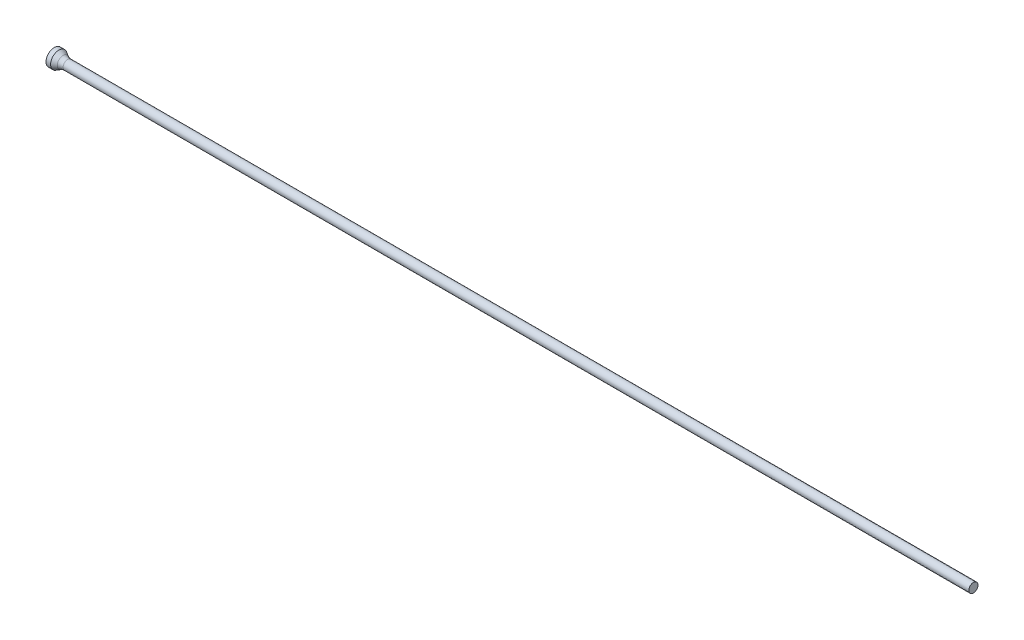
ISO-10303-21;
HEADER;
FILE_DESCRIPTION(('STEP AP214'),'2;1');
FILE_NAME('part.step','',(''),(''),'','','');
FILE_SCHEMA(('AUTOMOTIVE_DESIGN { 1 0 10303 214 1 1 1 1 }'));
ENDSEC;
DATA;
#1=APPLICATION_CONTEXT('core data for automotive mechanical design processes');
#2=APPLICATION_PROTOCOL_DEFINITION('international standard','automotive_design',2000,#1);
#3=PRODUCT_CONTEXT('',#1,'mechanical');
#4=PRODUCT('Part','Part','',(#3));
#5=PRODUCT_RELATED_PRODUCT_CATEGORY('part','',(#4));
#6=PRODUCT_DEFINITION_FORMATION('','',#4);
#7=PRODUCT_DEFINITION_CONTEXT('part definition',#1,'design');
#8=PRODUCT_DEFINITION('design','',#6,#7);
#9=PRODUCT_DEFINITION_SHAPE('','',#8);
#10=(LENGTH_UNIT() NAMED_UNIT(*) SI_UNIT(.MILLI.,.METRE.));
#11=(NAMED_UNIT(*) PLANE_ANGLE_UNIT() SI_UNIT($,.RADIAN.));
#12=(NAMED_UNIT(*) SI_UNIT($,.STERADIAN.) SOLID_ANGLE_UNIT());
#13=UNCERTAINTY_MEASURE_WITH_UNIT(LENGTH_MEASURE(1.E-05),#10,'distance_accuracy_value','');
#14=(GEOMETRIC_REPRESENTATION_CONTEXT(3) GLOBAL_UNCERTAINTY_ASSIGNED_CONTEXT((#13)) GLOBAL_UNIT_ASSIGNED_CONTEXT((#10,
#11,#12)) REPRESENTATION_CONTEXT('',''));
#15=CARTESIAN_POINT('',(0.,0.,0.));
#16=DIRECTION('',(0.,0.,1.));
#17=DIRECTION('',(1.,0.,0.));
#18=AXIS2_PLACEMENT_3D('',#15,#16,#17);
#19=CARTESIAN_POINT('',(0.,0.,0.));
#20=DIRECTION('',(1.,0.,0.));
#21=DIRECTION('',(0.,0.,-1.));
#22=AXIS2_PLACEMENT_3D('',#19,#20,#21);
#23=PLANE('',#22);
#24=CARTESIAN_POINT('',(0.,0.,0.));
#25=DIRECTION('',(-1.,0.,0.));
#26=DIRECTION('',(0.,0.,1.));
#27=AXIS2_PLACEMENT_3D('',#24,#25,#26);
#28=CIRCLE('',#27,0.9);
#29=CARTESIAN_POINT('',(0.,0.,0.9));
#30=VERTEX_POINT('',#29);
#31=EDGE_CURVE('E25',#30,#30,#28,.T.);
#32=ORIENTED_EDGE('',*,*,#31,.T.);
#33=EDGE_LOOP('',(#32));
#34=FACE_BOUND('',#33,.T.);
#35=ADVANCED_FACE('F14',(#34),#23,.F.);
#36=CARTESIAN_POINT('',(0.,0.,0.));
#37=DIRECTION('',(-1.,0.,0.));
#38=DIRECTION('',(0.,0.,1.));
#39=AXIS2_PLACEMENT_3D('',#36,#37,#38);
#40=CYLINDRICAL_SURFACE('',#39,0.9);
#41=ORIENTED_EDGE('',*,*,#31,.F.);
#42=EDGE_LOOP('',(#41));
#43=FACE_BOUND('',#42,.T.);
#44=CARTESIAN_POINT('',(0.497179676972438,0.,0.));
#45=DIRECTION('',(-1.,0.,0.));
#46=DIRECTION('',(0.,0.,1.));
#47=AXIS2_PLACEMENT_3D('',#44,#45,#46);
#48=CIRCLE('',#47,0.9);
#49=CARTESIAN_POINT('',(0.497179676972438,0.,0.9));
#50=VERTEX_POINT('',#49);
#51=EDGE_CURVE('E29',#50,#50,#48,.T.);
#52=ORIENTED_EDGE('',*,*,#51,.T.);
#53=EDGE_LOOP('',(#52));
#54=FACE_BOUND('',#53,.T.);
#55=ADVANCED_FACE('F53',(#43,#54),#40,.T.);
#56=CARTESIAN_POINT('',(1.19,0.,0.));
#57=DIRECTION('',(-1.,0.,0.));
#58=DIRECTION('',(0.,0.,1.));
#59=AXIS2_PLACEMENT_3D('',#56,#57,#58);
#60=CONICAL_SURFACE('',#59,0.5,0.523598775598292);
#61=CARTESIAN_POINT('',(0.957949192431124,0.,0.));
#62=DIRECTION('',(-1.,0.,0.));
#63=DIRECTION('',(0.,0.,1.));
#64=AXIS2_PLACEMENT_3D('',#61,#62,#63);
#65=CIRCLE('',#64,0.633974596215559);
#66=CARTESIAN_POINT('',(0.957949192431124,0.,0.633974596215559));
#67=VERTEX_POINT('',#66);
#68=EDGE_CURVE('E21',#67,#67,#65,.T.);
#69=ORIENTED_EDGE('',*,*,#68,.T.);
#70=EDGE_LOOP('',(#69));
#71=FACE_BOUND('',#70,.T.);
#72=ORIENTED_EDGE('',*,*,#51,.F.);
#73=EDGE_LOOP('',(#72));
#74=FACE_BOUND('',#73,.T.);
#75=ADVANCED_FACE('F50',(#71,#74),#60,.T.);
#76=CARTESIAN_POINT('',(0.,0.,0.));
#77=DIRECTION('',(-1.,0.,0.));
#78=DIRECTION('',(0.,0.,1.));
#79=AXIS2_PLACEMENT_3D('',#76,#77,#78);
#80=CYLINDRICAL_SURFACE('',#79,0.5);
#81=CARTESIAN_POINT('',(1.45794919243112,0.,0.));
#82=DIRECTION('',(-1.,0.,0.));
#83=DIRECTION('',(0.,0.,1.));
#84=AXIS2_PLACEMENT_3D('',#81,#82,#83);
#85=CIRCLE('',#84,0.5);
#86=CARTESIAN_POINT('',(1.45794919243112,0.,0.5));
#87=VERTEX_POINT('',#86);
#88=EDGE_CURVE('E9',#87,#87,#85,.F.);
#89=ORIENTED_EDGE('',*,*,#88,.T.);
#90=EDGE_LOOP('',(#89));
#91=FACE_BOUND('',#90,.T.);
#92=CARTESIAN_POINT('',(100.,0.,0.));
#93=DIRECTION('',(-1.,0.,0.));
#94=DIRECTION('',(0.,0.,1.));
#95=AXIS2_PLACEMENT_3D('',#92,#93,#94);
#96=CIRCLE('',#95,0.5);
#97=CARTESIAN_POINT('',(100.,0.,0.5));
#98=VERTEX_POINT('',#97);
#99=EDGE_CURVE('E34',#98,#98,#96,.T.);
#100=ORIENTED_EDGE('',*,*,#99,.T.);
#101=EDGE_LOOP('',(#100));
#102=FACE_BOUND('',#101,.T.);
#103=ADVANCED_FACE('F38',(#91,#102),#80,.T.);
#104=CARTESIAN_POINT('',(100.,0.5,0.));
#105=DIRECTION('',(-1.,0.,0.));
#106=DIRECTION('',(0.,0.,1.));
#107=AXIS2_PLACEMENT_3D('',#104,#105,#106);
#108=PLANE('',#107);
#109=ORIENTED_EDGE('',*,*,#99,.F.);
#110=EDGE_LOOP('',(#109));
#111=FACE_BOUND('',#110,.T.);
#112=ADVANCED_FACE('F40',(#111),#108,.F.);
#113=CARTESIAN_POINT('',(1.45794919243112,0.,0.));
#114=DIRECTION('',(-1.,0.,0.));
#115=DIRECTION('',(0.,0.,1.));
#116=AXIS2_PLACEMENT_3D('',#113,#114,#115);
#117=TOROIDAL_SURFACE('',#116,1.5,1.);
#118=ORIENTED_EDGE('',*,*,#88,.F.);
#119=EDGE_LOOP('',(#118));
#120=FACE_BOUND('',#119,.T.);
#121=ORIENTED_EDGE('',*,*,#68,.F.);
#122=EDGE_LOOP('',(#121));
#123=FACE_BOUND('',#122,.T.);
#124=ADVANCED_FACE('F16',(#120,#123),#117,.F.);
#125=CLOSED_SHELL('',(#35,#55,#75,#103,#112,#124));
#126=MANIFOLD_SOLID_BREP('B1',#125);
#127=ADVANCED_BREP_SHAPE_REPRESENTATION('',(#18,#126),#14);
#128=SHAPE_DEFINITION_REPRESENTATION(#9,#127);
ENDSEC;
END-ISO-10303-21;
